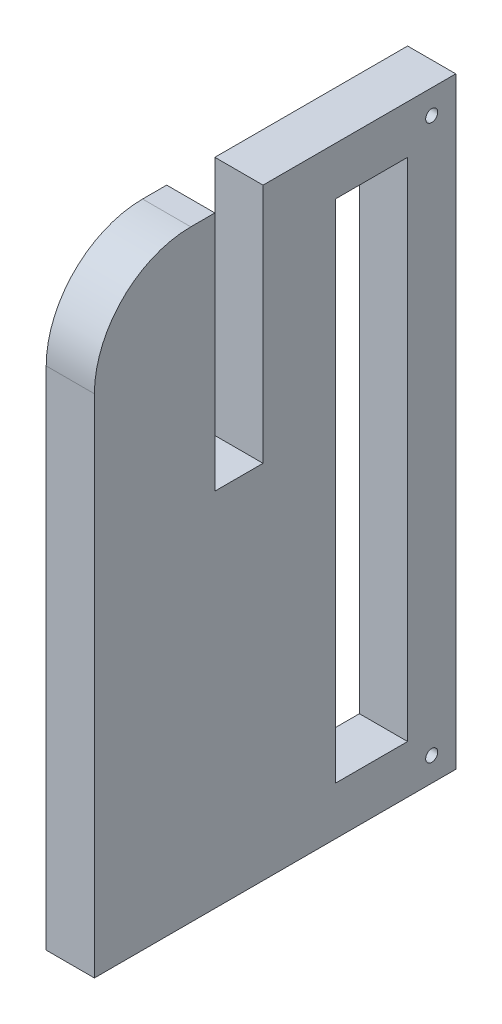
ISO-10303-21;
HEADER;
FILE_DESCRIPTION(('STEP AP214'),'2;1');
FILE_NAME('part.step','',(''),(''),'','','');
FILE_SCHEMA(('AUTOMOTIVE_DESIGN { 1 0 10303 214 1 1 1 1 }'));
ENDSEC;
DATA;
#1=APPLICATION_CONTEXT('core data for automotive mechanical design processes');
#2=APPLICATION_PROTOCOL_DEFINITION('international standard','automotive_design',2000,#1);
#3=PRODUCT_CONTEXT('',#1,'mechanical');
#4=PRODUCT('Part','Part','',(#3));
#5=PRODUCT_RELATED_PRODUCT_CATEGORY('part','',(#4));
#6=PRODUCT_DEFINITION_FORMATION('','',#4);
#7=PRODUCT_DEFINITION_CONTEXT('part definition',#1,'design');
#8=PRODUCT_DEFINITION('design','',#6,#7);
#9=PRODUCT_DEFINITION_SHAPE('','',#8);
#10=(LENGTH_UNIT() NAMED_UNIT(*) SI_UNIT(.MILLI.,.METRE.));
#11=(NAMED_UNIT(*) PLANE_ANGLE_UNIT() SI_UNIT($,.RADIAN.));
#12=(NAMED_UNIT(*) SI_UNIT($,.STERADIAN.) SOLID_ANGLE_UNIT());
#13=UNCERTAINTY_MEASURE_WITH_UNIT(LENGTH_MEASURE(1.E-05),#10,'distance_accuracy_value','');
#14=(GEOMETRIC_REPRESENTATION_CONTEXT(3) GLOBAL_UNCERTAINTY_ASSIGNED_CONTEXT((#13)) GLOBAL_UNIT_ASSIGNED_CONTEXT((#10,
#11,#12)) REPRESENTATION_CONTEXT('',''));
#15=CARTESIAN_POINT('',(0.,0.,0.));
#16=DIRECTION('',(0.,0.,1.));
#17=DIRECTION('',(1.,0.,0.));
#18=AXIS2_PLACEMENT_3D('',#15,#16,#17);
#19=CARTESIAN_POINT('',(1.,25.,-10.));
#20=DIRECTION('',(1.,0.,0.));
#21=DIRECTION('',(0.,1.,0.));
#22=AXIS2_PLACEMENT_3D('',#19,#20,#21);
#23=PLANE('',#22);
#24=CARTESIAN_POINT('',(0.999999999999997,0.999999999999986,-9.));
#25=DIRECTION('',(1.,0.,0.));
#26=DIRECTION('',(0.,1.,0.));
#27=AXIS2_PLACEMENT_3D('',#24,#25,#26);
#28=CIRCLE('',#27,0.25);
#29=CARTESIAN_POINT('',(0.999999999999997,1.24999999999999,-9.));
#30=VERTEX_POINT('',#29);
#31=EDGE_CURVE('E416',#30,#30,#28,.T.);
#32=ORIENTED_EDGE('',*,*,#31,.F.);
#33=EDGE_LOOP('',(#32));
#34=FACE_BOUND('',#33,.T.);
#35=CARTESIAN_POINT('',(1.,24.,-9.));
#36=DIRECTION('',(1.,0.,0.));
#37=DIRECTION('',(0.,1.,0.));
#38=AXIS2_PLACEMENT_3D('',#35,#36,#37);
#39=CIRCLE('',#38,0.25);
#40=CARTESIAN_POINT('',(1.,24.25,-9.));
#41=VERTEX_POINT('',#40);
#42=EDGE_CURVE('E153',#41,#41,#39,.T.);
#43=ORIENTED_EDGE('',*,*,#42,.F.);
#44=EDGE_LOOP('',(#43));
#45=FACE_BOUND('',#44,.T.);
#46=DIRECTION('',(0.,-1.,0.));
#47=VECTOR('',#46,1.);
#48=CARTESIAN_POINT('',(0.999999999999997,1.99999999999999,-5.));
#49=LINE('',#48,#47);
#50=CARTESIAN_POINT('',(1.,23.,-5.));
#51=VERTEX_POINT('',#50);
#52=CARTESIAN_POINT('',(0.999999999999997,1.99999999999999,-5.));
#53=VERTEX_POINT('',#52);
#54=EDGE_CURVE('E50',#51,#53,#49,.T.);
#55=ORIENTED_EDGE('',*,*,#54,.F.);
#56=DIRECTION('',(0.,0.,1.));
#57=VECTOR('',#56,1.);
#58=CARTESIAN_POINT('',(1.,23.,-5.));
#59=LINE('',#58,#57);
#60=CARTESIAN_POINT('',(1.,23.,-8.));
#61=VERTEX_POINT('',#60);
#62=EDGE_CURVE('E147',#61,#51,#59,.T.);
#63=ORIENTED_EDGE('',*,*,#62,.F.);
#64=DIRECTION('',(0.,1.,0.));
#65=VECTOR('',#64,1.);
#66=CARTESIAN_POINT('',(0.999999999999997,1.99999999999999,-8.));
#67=LINE('',#66,#65);
#68=CARTESIAN_POINT('',(0.999999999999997,1.99999999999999,-8.));
#69=VERTEX_POINT('',#68);
#70=EDGE_CURVE('E150',#69,#61,#67,.T.);
#71=ORIENTED_EDGE('',*,*,#70,.F.);
#72=DIRECTION('',(0.,0.,-1.));
#73=VECTOR('',#72,1.);
#74=CARTESIAN_POINT('',(0.999999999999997,1.99999999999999,-5.));
#75=LINE('',#74,#73);
#76=EDGE_CURVE('E159',#53,#69,#75,.T.);
#77=ORIENTED_EDGE('',*,*,#76,.F.);
#78=EDGE_LOOP('',(#55,#63,#71,#77));
#79=FACE_BOUND('',#78,.T.);
#80=DIRECTION('',(0.,0.,1.));
#81=VECTOR('',#80,1.);
#82=CARTESIAN_POINT('',(1.,25.,-10.));
#83=LINE('',#82,#81);
#84=CARTESIAN_POINT('',(1.,25.,0.));
#85=VERTEX_POINT('',#84);
#86=CARTESIAN_POINT('',(1.,25.,0.999999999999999));
#87=VERTEX_POINT('',#86);
#88=EDGE_CURVE('E211',#85,#87,#83,.T.);
#89=ORIENTED_EDGE('',*,*,#88,.T.);
#90=CARTESIAN_POINT('',(1.,21.,1.));
#91=DIRECTION('',(1.,0.,0.));
#92=DIRECTION('',(0.,1.,0.));
#93=AXIS2_PLACEMENT_3D('',#90,#91,#92);
#94=CIRCLE('',#93,4.);
#95=CARTESIAN_POINT('',(1.,21.,5.));
#96=VERTEX_POINT('',#95);
#97=EDGE_CURVE('E11',#87,#96,#94,.T.);
#98=ORIENTED_EDGE('',*,*,#97,.T.);
#99=DIRECTION('',(0.,1.,0.));
#100=VECTOR('',#99,1.);
#101=CARTESIAN_POINT('',(1.,25.,5.));
#102=LINE('',#101,#100);
#103=CARTESIAN_POINT('',(0.999999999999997,0.,5.));
#104=VERTEX_POINT('',#103);
#105=EDGE_CURVE('E191',#104,#96,#102,.T.);
#106=ORIENTED_EDGE('',*,*,#105,.F.);
#107=DIRECTION('',(0.,0.,1.));
#108=VECTOR('',#107,1.);
#109=CARTESIAN_POINT('',(0.999999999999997,0.,-10.));
#110=LINE('',#109,#108);
#111=CARTESIAN_POINT('',(0.999999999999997,0.,-10.));
#112=VERTEX_POINT('',#111);
#113=EDGE_CURVE('E212',#112,#104,#110,.T.);
#114=ORIENTED_EDGE('',*,*,#113,.F.);
#115=DIRECTION('',(0.,1.,0.));
#116=VECTOR('',#115,1.);
#117=CARTESIAN_POINT('',(1.,25.,-10.));
#118=LINE('',#117,#116);
#119=CARTESIAN_POINT('',(1.,25.,-10.));
#120=VERTEX_POINT('',#119);
#121=EDGE_CURVE('E199',#112,#120,#118,.T.);
#122=ORIENTED_EDGE('',*,*,#121,.T.);
#123=CARTESIAN_POINT('',(1.,25.,-2.));
#124=VERTEX_POINT('',#123);
#125=EDGE_CURVE('E222',#120,#124,#83,.T.);
#126=ORIENTED_EDGE('',*,*,#125,.T.);
#127=DIRECTION('',(0.,1.,0.));
#128=VECTOR('',#127,1.);
#129=CARTESIAN_POINT('',(1.,25.,-2.));
#130=LINE('',#129,#128);
#131=CARTESIAN_POINT('',(0.999999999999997,15.,-2.00000000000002));
#132=VERTEX_POINT('',#131);
#133=EDGE_CURVE('E183',#132,#124,#130,.T.);
#134=ORIENTED_EDGE('',*,*,#133,.F.);
#135=DIRECTION('',(0.,0.,1.));
#136=VECTOR('',#135,1.);
#137=CARTESIAN_POINT('',(0.999999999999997,15.,-2.00000000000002));
#138=LINE('',#137,#136);
#139=CARTESIAN_POINT('',(0.999999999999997,15.,0.));
#140=VERTEX_POINT('',#139);
#141=EDGE_CURVE('E166',#132,#140,#138,.T.);
#142=ORIENTED_EDGE('',*,*,#141,.T.);
#143=DIRECTION('',(0.,1.,0.));
#144=VECTOR('',#143,1.);
#145=CARTESIAN_POINT('',(1.,25.,0.));
#146=LINE('',#145,#144);
#147=EDGE_CURVE('E188',#140,#85,#146,.T.);
#148=ORIENTED_EDGE('',*,*,#147,.T.);
#149=EDGE_LOOP('',(#89,#98,#106,#114,#122,#126,#134,#142,#148));
#150=FACE_BOUND('',#149,.T.);
#151=ADVANCED_FACE('F35',(#34,#45,#79,#150),#23,.T.);
#152=CARTESIAN_POINT('',(-0.999999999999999,25.,-10.));
#153=DIRECTION('',(0.,1.,0.));
#154=DIRECTION('',(0.,0.,1.));
#155=AXIS2_PLACEMENT_3D('',#152,#153,#154);
#156=PLANE('',#155);
#157=DIRECTION('',(0.,0.,1.));
#158=VECTOR('',#157,1.);
#159=CARTESIAN_POINT('',(-0.999999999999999,25.,-10.));
#160=LINE('',#159,#158);
#161=CARTESIAN_POINT('',(-0.999999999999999,25.,0.));
#162=VERTEX_POINT('',#161);
#163=CARTESIAN_POINT('',(-0.999999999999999,25.,0.999999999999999));
#164=VERTEX_POINT('',#163);
#165=EDGE_CURVE('E221',#162,#164,#160,.T.);
#166=ORIENTED_EDGE('',*,*,#165,.T.);
#167=DIRECTION('',(-1.,0.,0.));
#168=VECTOR('',#167,1.);
#169=CARTESIAN_POINT('',(-0.999999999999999,25.,0.999999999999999));
#170=LINE('',#169,#168);
#171=EDGE_CURVE('E43',#164,#87,#170,.F.);
#172=ORIENTED_EDGE('',*,*,#171,.T.);
#173=ORIENTED_EDGE('',*,*,#88,.F.);
#174=DIRECTION('',(-1.,0.,0.));
#175=VECTOR('',#174,1.);
#176=CARTESIAN_POINT('',(-0.999999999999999,25.,0.));
#177=LINE('',#176,#175);
#178=EDGE_CURVE('E226',#85,#162,#177,.T.);
#179=ORIENTED_EDGE('',*,*,#178,.T.);
#180=EDGE_LOOP('',(#166,#172,#173,#179));
#181=FACE_BOUND('',#180,.T.);
#182=ADVANCED_FACE('F238',(#181),#156,.T.);
#183=CARTESIAN_POINT('',(-0.999999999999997,0.,-10.));
#184=DIRECTION('',(0.,-1.,0.));
#185=DIRECTION('',(1.,0.,0.));
#186=AXIS2_PLACEMENT_3D('',#183,#184,#185);
#187=PLANE('',#186);
#188=ORIENTED_EDGE('',*,*,#113,.T.);
#189=DIRECTION('',(1.,0.,0.));
#190=VECTOR('',#189,1.);
#191=CARTESIAN_POINT('',(-0.999999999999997,0.,5.));
#192=LINE('',#191,#190);
#193=CARTESIAN_POINT('',(-0.999999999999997,0.,5.));
#194=VERTEX_POINT('',#193);
#195=EDGE_CURVE('E196',#194,#104,#192,.T.);
#196=ORIENTED_EDGE('',*,*,#195,.F.);
#197=DIRECTION('',(0.,0.,1.));
#198=VECTOR('',#197,1.);
#199=CARTESIAN_POINT('',(-0.999999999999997,0.,-10.));
#200=LINE('',#199,#198);
#201=CARTESIAN_POINT('',(-0.999999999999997,0.,-10.));
#202=VERTEX_POINT('',#201);
#203=EDGE_CURVE('E215',#202,#194,#200,.T.);
#204=ORIENTED_EDGE('',*,*,#203,.F.);
#205=DIRECTION('',(1.,0.,0.));
#206=VECTOR('',#205,1.);
#207=CARTESIAN_POINT('',(-0.999999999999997,0.,-10.));
#208=LINE('',#207,#206);
#209=EDGE_CURVE('E208',#202,#112,#208,.T.);
#210=ORIENTED_EDGE('',*,*,#209,.T.);
#211=EDGE_LOOP('',(#188,#196,#204,#210));
#212=FACE_BOUND('',#211,.T.);
#213=ADVANCED_FACE('F252',(#212),#187,.T.);
#214=CARTESIAN_POINT('',(-0.999999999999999,25.,-10.));
#215=DIRECTION('',(-1.,0.,0.));
#216=DIRECTION('',(0.,-1.,0.));
#217=AXIS2_PLACEMENT_3D('',#214,#215,#216);
#218=PLANE('',#217);
#219=CARTESIAN_POINT('',(-1.,0.999999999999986,-9.));
#220=DIRECTION('',(1.,0.,0.));
#221=DIRECTION('',(0.,1.,0.));
#222=AXIS2_PLACEMENT_3D('',#219,#220,#221);
#223=CIRCLE('',#222,0.25);
#224=CARTESIAN_POINT('',(-1.,1.24999999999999,-9.));
#225=VERTEX_POINT('',#224);
#226=EDGE_CURVE('E160',#225,#225,#223,.T.);
#227=ORIENTED_EDGE('',*,*,#226,.T.);
#228=EDGE_LOOP('',(#227));
#229=FACE_BOUND('',#228,.T.);
#230=CARTESIAN_POINT('',(-0.999999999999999,24.,-9.));
#231=DIRECTION('',(1.,0.,0.));
#232=DIRECTION('',(0.,1.,0.));
#233=AXIS2_PLACEMENT_3D('',#230,#231,#232);
#234=CIRCLE('',#233,0.25);
#235=CARTESIAN_POINT('',(-0.999999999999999,24.25,-9.));
#236=VERTEX_POINT('',#235);
#237=EDGE_CURVE('E417',#236,#236,#234,.T.);
#238=ORIENTED_EDGE('',*,*,#237,.T.);
#239=EDGE_LOOP('',(#238));
#240=FACE_BOUND('',#239,.T.);
#241=DIRECTION('',(0.,-1.,0.));
#242=VECTOR('',#241,1.);
#243=CARTESIAN_POINT('',(-1.,1.99999999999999,-5.));
#244=LINE('',#243,#242);
#245=CARTESIAN_POINT('',(-1.,23.,-5.));
#246=VERTEX_POINT('',#245);
#247=CARTESIAN_POINT('',(-1.,1.99999999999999,-5.));
#248=VERTEX_POINT('',#247);
#249=EDGE_CURVE('E131',#246,#248,#244,.T.);
#250=ORIENTED_EDGE('',*,*,#249,.T.);
#251=DIRECTION('',(0.,0.,-1.));
#252=VECTOR('',#251,1.);
#253=CARTESIAN_POINT('',(-1.,1.99999999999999,-5.));
#254=LINE('',#253,#252);
#255=CARTESIAN_POINT('',(-0.999999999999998,1.99999999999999,-8.));
#256=VERTEX_POINT('',#255);
#257=EDGE_CURVE('E140',#248,#256,#254,.T.);
#258=ORIENTED_EDGE('',*,*,#257,.T.);
#259=DIRECTION('',(0.,1.,0.));
#260=VECTOR('',#259,1.);
#261=CARTESIAN_POINT('',(-1.,1.99999999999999,-8.));
#262=LINE('',#261,#260);
#263=CARTESIAN_POINT('',(-1.,23.,-8.));
#264=VERTEX_POINT('',#263);
#265=EDGE_CURVE('E58',#256,#264,#262,.T.);
#266=ORIENTED_EDGE('',*,*,#265,.T.);
#267=DIRECTION('',(0.,0.,1.));
#268=VECTOR('',#267,1.);
#269=CARTESIAN_POINT('',(-1.,23.,-5.));
#270=LINE('',#269,#268);
#271=EDGE_CURVE('E137',#264,#246,#270,.T.);
#272=ORIENTED_EDGE('',*,*,#271,.T.);
#273=EDGE_LOOP('',(#250,#258,#266,#272));
#274=FACE_BOUND('',#273,.T.);
#275=DIRECTION('',(0.,-1.,0.));
#276=VECTOR('',#275,1.);
#277=CARTESIAN_POINT('',(-0.999999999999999,25.,5.));
#278=LINE('',#277,#276);
#279=CARTESIAN_POINT('',(-0.999999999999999,21.,5.));
#280=VERTEX_POINT('',#279);
#281=EDGE_CURVE('E194',#280,#194,#278,.T.);
#282=ORIENTED_EDGE('',*,*,#281,.F.);
#283=CARTESIAN_POINT('',(-0.999999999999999,21.,1.));
#284=DIRECTION('',(-1.,0.,0.));
#285=DIRECTION('',(0.,-1.,0.));
#286=AXIS2_PLACEMENT_3D('',#283,#284,#285);
#287=CIRCLE('',#286,4.);
#288=EDGE_CURVE('E232',#280,#164,#287,.T.);
#289=ORIENTED_EDGE('',*,*,#288,.T.);
#290=ORIENTED_EDGE('',*,*,#165,.F.);
#291=DIRECTION('',(0.,-1.,0.));
#292=VECTOR('',#291,1.);
#293=CARTESIAN_POINT('',(-0.999999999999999,25.,0.));
#294=LINE('',#293,#292);
#295=CARTESIAN_POINT('',(-0.999999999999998,15.,0.));
#296=VERTEX_POINT('',#295);
#297=EDGE_CURVE('E185',#162,#296,#294,.T.);
#298=ORIENTED_EDGE('',*,*,#297,.T.);
#299=DIRECTION('',(0.,0.,-1.));
#300=VECTOR('',#299,1.);
#301=CARTESIAN_POINT('',(-0.999999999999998,15.,-2.00000000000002));
#302=LINE('',#301,#300);
#303=CARTESIAN_POINT('',(-0.999999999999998,15.,-2.));
#304=VERTEX_POINT('',#303);
#305=EDGE_CURVE('E175',#296,#304,#302,.T.);
#306=ORIENTED_EDGE('',*,*,#305,.T.);
#307=DIRECTION('',(0.,-1.,0.));
#308=VECTOR('',#307,1.);
#309=CARTESIAN_POINT('',(-0.999999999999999,25.,-2.));
#310=LINE('',#309,#308);
#311=CARTESIAN_POINT('',(-0.999999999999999,25.,-2.));
#312=VERTEX_POINT('',#311);
#313=EDGE_CURVE('E181',#312,#304,#310,.T.);
#314=ORIENTED_EDGE('',*,*,#313,.F.);
#315=CARTESIAN_POINT('',(-0.999999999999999,25.,-10.));
#316=VERTEX_POINT('',#315);
#317=EDGE_CURVE('E218',#316,#312,#160,.T.);
#318=ORIENTED_EDGE('',*,*,#317,.F.);
#319=DIRECTION('',(0.,-1.,0.));
#320=VECTOR('',#319,1.);
#321=CARTESIAN_POINT('',(-0.999999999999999,25.,-10.));
#322=LINE('',#321,#320);
#323=EDGE_CURVE('E205',#316,#202,#322,.T.);
#324=ORIENTED_EDGE('',*,*,#323,.T.);
#325=ORIENTED_EDGE('',*,*,#203,.T.);
#326=EDGE_LOOP('',(#282,#289,#290,#298,#306,#314,#318,#324,#325));
#327=FACE_BOUND('',#326,.T.);
#328=ADVANCED_FACE('F144',(#229,#240,#274,#327),#218,.T.);
#329=DIRECTION('',(-1.,0.,0.));
#330=VECTOR('',#329,1.);
#331=CARTESIAN_POINT('',(-0.999999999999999,25.,-2.));
#332=LINE('',#331,#330);
#333=EDGE_CURVE('E214',#124,#312,#332,.T.);
#334=ORIENTED_EDGE('',*,*,#333,.F.);
#335=ORIENTED_EDGE('',*,*,#125,.F.);
#336=DIRECTION('',(-1.,0.,0.));
#337=VECTOR('',#336,1.);
#338=CARTESIAN_POINT('',(-0.999999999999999,25.,-10.));
#339=LINE('',#338,#337);
#340=EDGE_CURVE('E202',#120,#316,#339,.T.);
#341=ORIENTED_EDGE('',*,*,#340,.T.);
#342=ORIENTED_EDGE('',*,*,#317,.T.);
#343=EDGE_LOOP('',(#334,#335,#341,#342));
#344=FACE_BOUND('',#343,.T.);
#345=ADVANCED_FACE('F259',(#344),#156,.T.);
#346=CARTESIAN_POINT('',(0.,0.,-10.));
#347=DIRECTION('',(0.,0.,1.));
#348=DIRECTION('',(1.,0.,0.));
#349=AXIS2_PLACEMENT_3D('',#346,#347,#348);
#350=PLANE('',#349);
#351=ORIENTED_EDGE('',*,*,#121,.F.);
#352=ORIENTED_EDGE('',*,*,#209,.F.);
#353=ORIENTED_EDGE('',*,*,#323,.F.);
#354=ORIENTED_EDGE('',*,*,#340,.F.);
#355=EDGE_LOOP('',(#351,#352,#353,#354));
#356=FACE_BOUND('',#355,.T.);
#357=ADVANCED_FACE('F256',(#356),#350,.F.);
#358=CARTESIAN_POINT('',(0.,0.,5.));
#359=DIRECTION('',(0.,0.,1.));
#360=DIRECTION('',(1.,0.,0.));
#361=AXIS2_PLACEMENT_3D('',#358,#359,#360);
#362=PLANE('',#361);
#363=ORIENTED_EDGE('',*,*,#105,.T.);
#364=DIRECTION('',(-1.,0.,0.));
#365=VECTOR('',#364,1.);
#366=CARTESIAN_POINT('',(0.,21.,5.));
#367=LINE('',#366,#365);
#368=EDGE_CURVE('E229',#96,#280,#367,.T.);
#369=ORIENTED_EDGE('',*,*,#368,.T.);
#370=ORIENTED_EDGE('',*,*,#281,.T.);
#371=ORIENTED_EDGE('',*,*,#195,.T.);
#372=EDGE_LOOP('',(#363,#369,#370,#371));
#373=FACE_BOUND('',#372,.T.);
#374=ADVANCED_FACE('F247',(#373),#362,.T.);
#375=CARTESIAN_POINT('',(0.,20.,0.));
#376=DIRECTION('',(0.,0.,-1.));
#377=DIRECTION('',(0.,1.,0.));
#378=AXIS2_PLACEMENT_3D('',#375,#376,#377);
#379=PLANE('',#378);
#380=DIRECTION('',(-1.,0.,0.));
#381=VECTOR('',#380,1.);
#382=CARTESIAN_POINT('',(0.999999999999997,15.,0.));
#383=LINE('',#382,#381);
#384=EDGE_CURVE('E172',#140,#296,#383,.T.);
#385=ORIENTED_EDGE('',*,*,#384,.T.);
#386=ORIENTED_EDGE('',*,*,#297,.F.);
#387=ORIENTED_EDGE('',*,*,#178,.F.);
#388=ORIENTED_EDGE('',*,*,#147,.F.);
#389=EDGE_LOOP('',(#385,#386,#387,#388));
#390=FACE_BOUND('',#389,.T.);
#391=ADVANCED_FACE('F269',(#390),#379,.T.);
#392=CARTESIAN_POINT('',(0.,20.,-2.));
#393=DIRECTION('',(0.,0.,-1.));
#394=DIRECTION('',(0.,1.,0.));
#395=AXIS2_PLACEMENT_3D('',#392,#393,#394);
#396=PLANE('',#395);
#397=ORIENTED_EDGE('',*,*,#133,.T.);
#398=ORIENTED_EDGE('',*,*,#333,.T.);
#399=ORIENTED_EDGE('',*,*,#313,.T.);
#400=DIRECTION('',(1.,0.,0.));
#401=VECTOR('',#400,1.);
#402=CARTESIAN_POINT('',(0.999999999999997,15.,-2.00000000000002));
#403=LINE('',#402,#401);
#404=EDGE_CURVE('E178',#304,#132,#403,.T.);
#405=ORIENTED_EDGE('',*,*,#404,.T.);
#406=EDGE_LOOP('',(#397,#398,#399,#405));
#407=FACE_BOUND('',#406,.T.);
#408=ADVANCED_FACE('F262',(#407),#396,.F.);
#409=CARTESIAN_POINT('',(0.,15.,-2.));
#410=DIRECTION('',(0.,-1.,0.));
#411=DIRECTION('',(1.,0.,0.));
#412=AXIS2_PLACEMENT_3D('',#409,#410,#411);
#413=PLANE('',#412);
#414=ORIENTED_EDGE('',*,*,#141,.F.);
#415=ORIENTED_EDGE('',*,*,#404,.F.);
#416=ORIENTED_EDGE('',*,*,#305,.F.);
#417=ORIENTED_EDGE('',*,*,#384,.F.);
#418=EDGE_LOOP('',(#414,#415,#416,#417));
#419=FACE_BOUND('',#418,.T.);
#420=ADVANCED_FACE('F266',(#419),#413,.F.);
#421=CARTESIAN_POINT('',(0.,21.,1.));
#422=DIRECTION('',(-1.,0.,0.));
#423=DIRECTION('',(0.,0.,1.));
#424=AXIS2_PLACEMENT_3D('',#421,#422,#423);
#425=CYLINDRICAL_SURFACE('',#424,4.);
#426=ORIENTED_EDGE('',*,*,#97,.F.);
#427=ORIENTED_EDGE('',*,*,#171,.F.);
#428=ORIENTED_EDGE('',*,*,#288,.F.);
#429=ORIENTED_EDGE('',*,*,#368,.F.);
#430=EDGE_LOOP('',(#426,#427,#428,#429));
#431=FACE_BOUND('',#430,.T.);
#432=ADVANCED_FACE('F37',(#431),#425,.T.);
#433=CARTESIAN_POINT('',(-1.,1.99999999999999,-5.));
#434=DIRECTION('',(0.,0.,1.));
#435=DIRECTION('',(1.,0.,0.));
#436=AXIS2_PLACEMENT_3D('',#433,#434,#435);
#437=PLANE('',#436);
#438=ORIENTED_EDGE('',*,*,#54,.T.);
#439=DIRECTION('',(1.,0.,0.));
#440=VECTOR('',#439,1.);
#441=CARTESIAN_POINT('',(-1.,1.99999999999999,-5.));
#442=LINE('',#441,#440);
#443=EDGE_CURVE('E127',#248,#53,#442,.T.);
#444=ORIENTED_EDGE('',*,*,#443,.F.);
#445=ORIENTED_EDGE('',*,*,#249,.F.);
#446=DIRECTION('',(1.,0.,0.));
#447=VECTOR('',#446,1.);
#448=CARTESIAN_POINT('',(-1.,23.,-5.));
#449=LINE('',#448,#447);
#450=EDGE_CURVE('E164',#246,#51,#449,.T.);
#451=ORIENTED_EDGE('',*,*,#450,.T.);
#452=EDGE_LOOP('',(#438,#444,#445,#451));
#453=FACE_BOUND('',#452,.T.);
#454=ADVANCED_FACE('F129',(#453),#437,.F.);
#455=CARTESIAN_POINT('',(-1.,23.,-5.));
#456=DIRECTION('',(0.,1.,0.));
#457=DIRECTION('',(-1.,0.,0.));
#458=AXIS2_PLACEMENT_3D('',#455,#456,#457);
#459=PLANE('',#458);
#460=ORIENTED_EDGE('',*,*,#62,.T.);
#461=ORIENTED_EDGE('',*,*,#450,.F.);
#462=ORIENTED_EDGE('',*,*,#271,.F.);
#463=DIRECTION('',(1.,0.,0.));
#464=VECTOR('',#463,1.);
#465=CARTESIAN_POINT('',(-1.,23.,-8.));
#466=LINE('',#465,#464);
#467=EDGE_CURVE('E167',#264,#61,#466,.T.);
#468=ORIENTED_EDGE('',*,*,#467,.T.);
#469=EDGE_LOOP('',(#460,#461,#462,#468));
#470=FACE_BOUND('',#469,.T.);
#471=ADVANCED_FACE('F326',(#470),#459,.F.);
#472=CARTESIAN_POINT('',(-1.,1.99999999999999,-8.));
#473=DIRECTION('',(0.,0.,-1.));
#474=DIRECTION('',(-1.,0.,0.));
#475=AXIS2_PLACEMENT_3D('',#472,#473,#474);
#476=PLANE('',#475);
#477=ORIENTED_EDGE('',*,*,#70,.T.);
#478=ORIENTED_EDGE('',*,*,#467,.F.);
#479=ORIENTED_EDGE('',*,*,#265,.F.);
#480=DIRECTION('',(1.,0.,0.));
#481=VECTOR('',#480,1.);
#482=CARTESIAN_POINT('',(-1.,1.99999999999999,-8.));
#483=LINE('',#482,#481);
#484=EDGE_CURVE('E136',#256,#69,#483,.T.);
#485=ORIENTED_EDGE('',*,*,#484,.T.);
#486=EDGE_LOOP('',(#477,#478,#479,#485));
#487=FACE_BOUND('',#486,.T.);
#488=ADVANCED_FACE('F335',(#487),#476,.F.);
#489=CARTESIAN_POINT('',(-1.,1.99999999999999,-5.));
#490=DIRECTION('',(0.,-1.,0.));
#491=DIRECTION('',(1.,0.,0.));
#492=AXIS2_PLACEMENT_3D('',#489,#490,#491);
#493=PLANE('',#492);
#494=ORIENTED_EDGE('',*,*,#76,.T.);
#495=ORIENTED_EDGE('',*,*,#484,.F.);
#496=ORIENTED_EDGE('',*,*,#257,.F.);
#497=ORIENTED_EDGE('',*,*,#443,.T.);
#498=EDGE_LOOP('',(#494,#495,#496,#497));
#499=FACE_BOUND('',#498,.T.);
#500=ADVANCED_FACE('F141',(#499),#493,.F.);
#501=CARTESIAN_POINT('',(-0.999999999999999,24.,-9.));
#502=DIRECTION('',(1.,0.,0.));
#503=DIRECTION('',(0.,1.,0.));
#504=AXIS2_PLACEMENT_3D('',#501,#502,#503);
#505=CYLINDRICAL_SURFACE('',#504,0.25);
#506=ORIENTED_EDGE('',*,*,#237,.F.);
#507=EDGE_LOOP('',(#506));
#508=FACE_BOUND('',#507,.T.);
#509=ORIENTED_EDGE('',*,*,#42,.T.);
#510=EDGE_LOOP('',(#509));
#511=FACE_BOUND('',#510,.T.);
#512=ADVANCED_FACE('F352',(#508,#511),#505,.F.);
#513=CARTESIAN_POINT('',(-1.,0.999999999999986,-9.));
#514=DIRECTION('',(1.,0.,0.));
#515=DIRECTION('',(0.,1.,0.));
#516=AXIS2_PLACEMENT_3D('',#513,#514,#515);
#517=CYLINDRICAL_SURFACE('',#516,0.25);
#518=ORIENTED_EDGE('',*,*,#226,.F.);
#519=EDGE_LOOP('',(#518));
#520=FACE_BOUND('',#519,.T.);
#521=ORIENTED_EDGE('',*,*,#31,.T.);
#522=EDGE_LOOP('',(#521));
#523=FACE_BOUND('',#522,.T.);
#524=ADVANCED_FACE('F375',(#520,#523),#517,.F.);
#525=CLOSED_SHELL('',(#151,#182,#213,#328,#345,#357,#374,#391,#408,#420,#432,#454,#471,#488,
#500,#512,#524));
#526=MANIFOLD_SOLID_BREP('B2',#525);
#527=ADVANCED_BREP_SHAPE_REPRESENTATION('',(#18,#526),#14);
#528=SHAPE_DEFINITION_REPRESENTATION(#9,#527);
ENDSEC;
END-ISO-10303-21;
